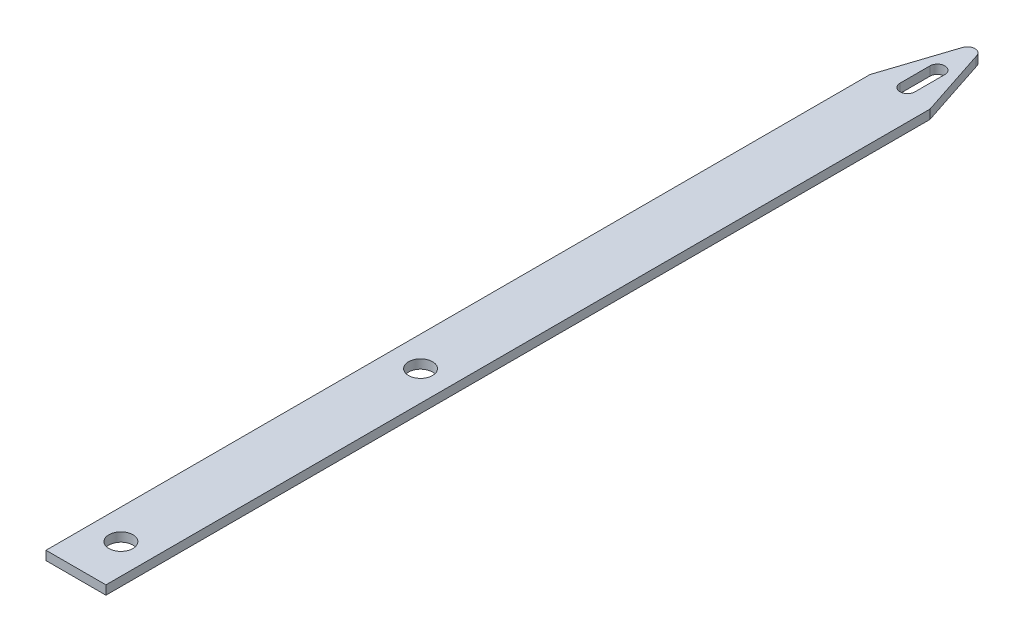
from build123d import *

# Parameters (mm, degrees)
EXTRUDE1_DEPTH      = 20
EXTRUDE1_DEPTH_BACK = 20
SKETCH1_W           = 4
SKETCH1_H           = 0.6
SKETCH2_R           = 0.8
CUT_EXTRUDE1_DEPTH  = 21.404901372
SKETCH3_W           = 4
SKETCH3_H           = 0.6
EXTRUDE2_DEPTH      = 20
SKETCH4_R           = 0.8
CUT_EXTRUDE2_DEPTH  = 41.203979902


with BuildPart() as part:
    # Sketch1 → Extrude1 (new, two sides: drawn at the far end of the back side and taken through both)
    with BuildSketch(Plane.XY.offset(-EXTRUDE1_DEPTH_BACK)):
        with Locations((2, 0.3)):
            Rectangle(SKETCH1_W, SKETCH1_H)
    extrude(amount=EXTRUDE1_DEPTH + EXTRUDE1_DEPTH_BACK)

    # Sketch2 → Cut-Extrude1 (cut, through all)
    with BuildSketch(Plane(origin=(0, 0.6, 0), x_dir=(1, 0, 0), z_dir=(0, 1, 0))):
        with BuildLine():
            Line((1.5, 17.5), (1.5, 15.5))
            ThreePointArc((1.5, 15.5), (2, 15), (2.5, 15.5))
            Line((2.5, 15.5), (2.5, 17.5))
            ThreePointArc((2.5, 17.5), (2, 18), (1.5, 17.5))
        make_face()
        with BuildLine():
            Line((0, 20), (0, 15))
            Line((0, 15), (1.524836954, 19.655628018))
            ThreePointArc((1.524836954, 19.655628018), (1.706583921, 19.9048543), (2, 20))
            Line((2, 20), (0, 20))
        make_face()
        with BuildLine():
            Line((2.490312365, 19.59794787), (4, 15))
            Line((4, 15), (4, 20))
            Line((4, 20), (2, 20))
            ThreePointArc((2, 20), (2.317037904, 19.886635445), (2.490312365, 19.59794787))
        make_face()
        with Locations(Location((2, -17, 0), (0, 0, 90))):
            Circle(SKETCH2_R)
    extrude(amount=-CUT_EXTRUDE1_DEPTH, mode=Mode.SUBTRACT)

    # Sketch3 → Extrude2 (add)
    with BuildSketch(Plane.XY.offset(20)):
        with Locations((2, 0.3)):
            Rectangle(SKETCH3_W, SKETCH3_H)
    extrude(amount=EXTRUDE2_DEPTH)

    # Sketch4 → Cut-Extrude2 (cut, through all)
    with BuildSketch(Plane(origin=(0, 0.6, 0), x_dir=(1, 0, 0), z_dir=(0, 1, 0))):
        with Locations(Location((2, -37, 0), (0, 0, 270))):
            Circle(SKETCH4_R)
    extrude(amount=-CUT_EXTRUDE2_DEPTH, mode=Mode.SUBTRACT)


solid = part.part
